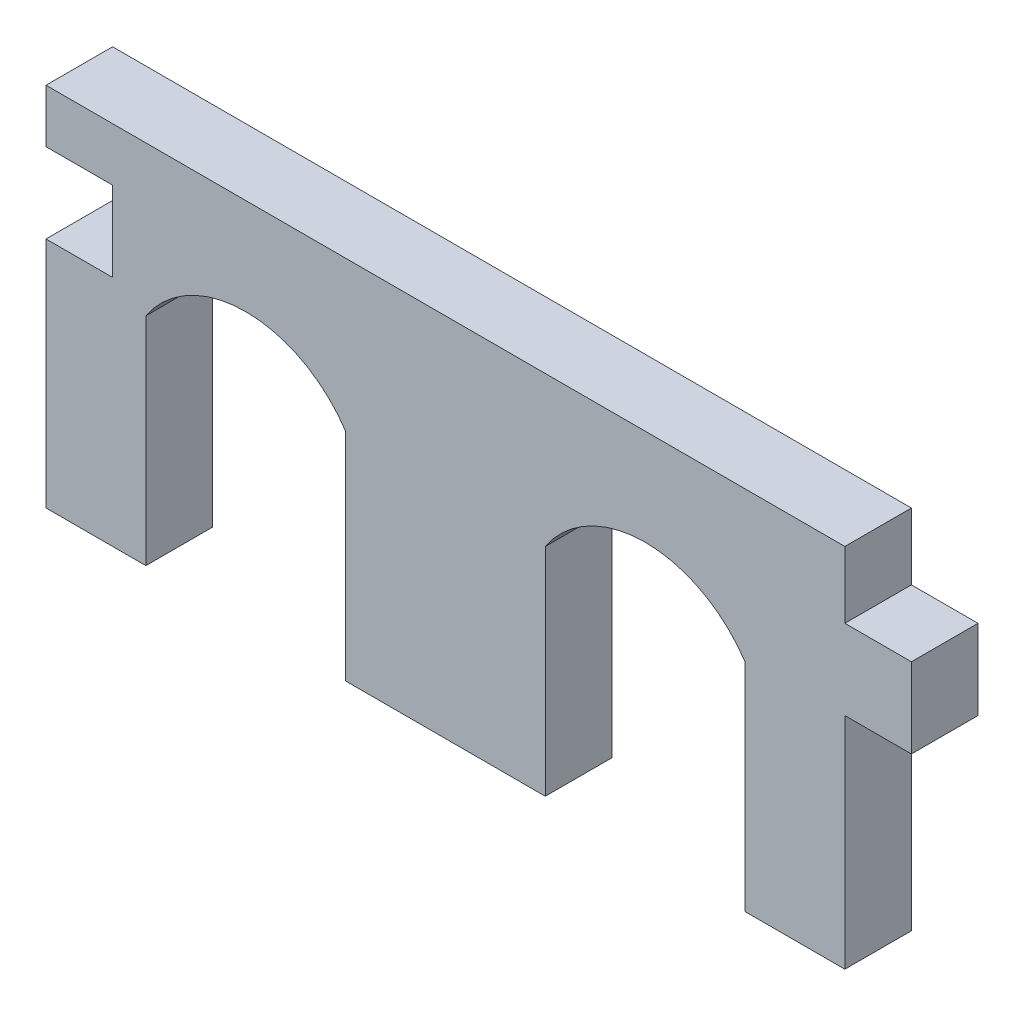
ISO-10303-21;
HEADER;
FILE_DESCRIPTION(('STEP AP214'),'2;1');
FILE_NAME('part.step','',(''),(''),'','','');
FILE_SCHEMA(('AUTOMOTIVE_DESIGN { 1 0 10303 214 1 1 1 1 }'));
ENDSEC;
DATA;
#1=APPLICATION_CONTEXT('core data for automotive mechanical design processes');
#2=APPLICATION_PROTOCOL_DEFINITION('international standard','automotive_design',2000,#1);
#3=PRODUCT_CONTEXT('',#1,'mechanical');
#4=PRODUCT('Part','Part','',(#3));
#5=PRODUCT_RELATED_PRODUCT_CATEGORY('part','',(#4));
#6=PRODUCT_DEFINITION_FORMATION('','',#4);
#7=PRODUCT_DEFINITION_CONTEXT('part definition',#1,'design');
#8=PRODUCT_DEFINITION('design','',#6,#7);
#9=PRODUCT_DEFINITION_SHAPE('','',#8);
#10=(LENGTH_UNIT() NAMED_UNIT(*) SI_UNIT(.MILLI.,.METRE.));
#11=(NAMED_UNIT(*) PLANE_ANGLE_UNIT() SI_UNIT($,.RADIAN.));
#12=(NAMED_UNIT(*) SI_UNIT($,.STERADIAN.) SOLID_ANGLE_UNIT());
#13=UNCERTAINTY_MEASURE_WITH_UNIT(LENGTH_MEASURE(1.E-05),#10,'distance_accuracy_value','');
#14=(GEOMETRIC_REPRESENTATION_CONTEXT(3) GLOBAL_UNCERTAINTY_ASSIGNED_CONTEXT((#13)) GLOBAL_UNIT_ASSIGNED_CONTEXT((#10,
#11,#12)) REPRESENTATION_CONTEXT('',''));
#15=CARTESIAN_POINT('',(0.,0.,0.));
#16=DIRECTION('',(0.,0.,1.));
#17=DIRECTION('',(1.,0.,0.));
#18=AXIS2_PLACEMENT_3D('',#15,#16,#17);
#19=CARTESIAN_POINT('',(0.,-6.35,6.35));
#20=DIRECTION('',(0.,1.,0.));
#21=DIRECTION('',(0.,0.,1.));
#22=AXIS2_PLACEMENT_3D('',#19,#20,#21);
#23=PLANE('',#22);
#24=DIRECTION('',(1.,0.,0.));
#25=VECTOR('',#24,1.);
#26=CARTESIAN_POINT('',(0.,-6.35,0.));
#27=LINE('',#26,#25);
#28=CARTESIAN_POINT('',(-47.625,-6.35,0.));
#29=VERTEX_POINT('',#28);
#30=CARTESIAN_POINT('',(-28.575,-6.35,0.));
#31=VERTEX_POINT('',#30);
#32=EDGE_CURVE('E221',#29,#31,#27,.T.);
#33=ORIENTED_EDGE('',*,*,#32,.T.);
#34=DIRECTION('',(0.,0.,-1.));
#35=VECTOR('',#34,1.);
#36=CARTESIAN_POINT('',(-28.575,-6.35,6.35));
#37=LINE('',#36,#35);
#38=CARTESIAN_POINT('',(-28.575,-6.35,6.35));
#39=VERTEX_POINT('',#38);
#40=EDGE_CURVE('E11',#39,#31,#37,.T.);
#41=ORIENTED_EDGE('',*,*,#40,.F.);
#42=DIRECTION('',(1.,0.,0.));
#43=VECTOR('',#42,1.);
#44=CARTESIAN_POINT('',(0.,-6.35,6.35));
#45=LINE('',#44,#43);
#46=CARTESIAN_POINT('',(-47.625,-6.35,6.35));
#47=VERTEX_POINT('',#46);
#48=EDGE_CURVE('E287',#47,#39,#45,.T.);
#49=ORIENTED_EDGE('',*,*,#48,.F.);
#50=DIRECTION('',(0.,0.,-1.));
#51=VECTOR('',#50,1.);
#52=CARTESIAN_POINT('',(-47.625,-6.35,6.35));
#53=LINE('',#52,#51);
#54=EDGE_CURVE('E64',#47,#29,#53,.T.);
#55=ORIENTED_EDGE('',*,*,#54,.T.);
#56=EDGE_LOOP('',(#33,#41,#49,#55));
#57=FACE_BOUND('',#56,.T.);
#58=ADVANCED_FACE('F47',(#57),#23,.F.);
#59=CARTESIAN_POINT('',(-28.575,0.,6.35));
#60=DIRECTION('',(-1.,0.,0.));
#61=DIRECTION('',(0.,-1.,0.));
#62=AXIS2_PLACEMENT_3D('',#59,#60,#61);
#63=PLANE('',#62);
#64=DIRECTION('',(0.,1.,0.));
#65=VECTOR('',#64,1.);
#66=CARTESIAN_POINT('',(-28.575,0.,0.));
#67=LINE('',#66,#65);
#68=CARTESIAN_POINT('',(-28.575,14.2875,0.));
#69=VERTEX_POINT('',#68);
#70=EDGE_CURVE('E224',#31,#69,#67,.T.);
#71=ORIENTED_EDGE('',*,*,#70,.T.);
#72=DIRECTION('',(0.,0.,-1.));
#73=VECTOR('',#72,1.);
#74=CARTESIAN_POINT('',(-28.575,14.2875,6.35));
#75=LINE('',#74,#73);
#76=CARTESIAN_POINT('',(-28.575,14.2875,6.35));
#77=VERTEX_POINT('',#76);
#78=EDGE_CURVE('E56',#77,#69,#75,.T.);
#79=ORIENTED_EDGE('',*,*,#78,.F.);
#80=DIRECTION('',(0.,1.,0.));
#81=VECTOR('',#80,1.);
#82=CARTESIAN_POINT('',(-28.575,0.,6.35));
#83=LINE('',#82,#81);
#84=EDGE_CURVE('E139',#39,#77,#83,.T.);
#85=ORIENTED_EDGE('',*,*,#84,.F.);
#86=ORIENTED_EDGE('',*,*,#40,.T.);
#87=EDGE_LOOP('',(#71,#79,#85,#86));
#88=FACE_BOUND('',#87,.T.);
#89=ADVANCED_FACE('F420',(#88),#63,.F.);
#90=CARTESIAN_POINT('',(-19.05,7.96932977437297,6.35));
#91=DIRECTION('',(0.,0.,-1.));
#92=DIRECTION('',(-1.,0.,0.));
#93=AXIS2_PLACEMENT_3D('',#90,#91,#92);
#94=CYLINDRICAL_SURFACE('',#93,11.43);
#95=CARTESIAN_POINT('',(-19.05,7.96932977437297,0.));
#96=DIRECTION('',(0.,0.,1.));
#97=DIRECTION('',(1.,0.,0.));
#98=AXIS2_PLACEMENT_3D('',#95,#96,#97);
#99=CIRCLE('',#98,11.43);
#100=CARTESIAN_POINT('',(-9.52500000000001,14.2875,0.));
#101=VERTEX_POINT('',#100);
#102=EDGE_CURVE('E227',#69,#101,#99,.F.);
#103=ORIENTED_EDGE('',*,*,#102,.T.);
#104=DIRECTION('',(0.,0.,-1.));
#105=VECTOR('',#104,1.);
#106=CARTESIAN_POINT('',(-9.52500000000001,14.2875,6.35));
#107=LINE('',#106,#105);
#108=CARTESIAN_POINT('',(-9.52500000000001,14.2875,6.35));
#109=VERTEX_POINT('',#108);
#110=EDGE_CURVE('E336',#109,#101,#107,.T.);
#111=ORIENTED_EDGE('',*,*,#110,.F.);
#112=CARTESIAN_POINT('',(-19.05,7.96932977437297,6.35));
#113=DIRECTION('',(0.,0.,1.));
#114=DIRECTION('',(1.,0.,0.));
#115=AXIS2_PLACEMENT_3D('',#112,#113,#114);
#116=CIRCLE('',#115,11.43);
#117=EDGE_CURVE('E345',#77,#109,#116,.F.);
#118=ORIENTED_EDGE('',*,*,#117,.F.);
#119=ORIENTED_EDGE('',*,*,#78,.T.);
#120=EDGE_LOOP('',(#103,#111,#118,#119));
#121=FACE_BOUND('',#120,.T.);
#122=ADVANCED_FACE('F343',(#121),#94,.F.);
#123=CARTESIAN_POINT('',(-9.52500000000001,0.,6.35));
#124=DIRECTION('',(-1.,0.,0.));
#125=DIRECTION('',(0.,0.,1.));
#126=AXIS2_PLACEMENT_3D('',#123,#124,#125);
#127=PLANE('',#126);
#128=DIRECTION('',(0.,1.,0.));
#129=VECTOR('',#128,1.);
#130=CARTESIAN_POINT('',(-9.52500000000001,0.,0.));
#131=LINE('',#130,#129);
#132=CARTESIAN_POINT('',(-9.52500000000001,-6.35,0.));
#133=VERTEX_POINT('',#132);
#134=EDGE_CURVE('E231',#133,#101,#131,.T.);
#135=ORIENTED_EDGE('',*,*,#134,.F.);
#136=DIRECTION('',(0.,0.,-1.));
#137=VECTOR('',#136,1.);
#138=CARTESIAN_POINT('',(-9.52500000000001,-6.35,6.35));
#139=LINE('',#138,#137);
#140=CARTESIAN_POINT('',(-9.52500000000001,-6.35,6.35));
#141=VERTEX_POINT('',#140);
#142=EDGE_CURVE('E333',#141,#133,#139,.T.);
#143=ORIENTED_EDGE('',*,*,#142,.F.);
#144=DIRECTION('',(0.,1.,0.));
#145=VECTOR('',#144,1.);
#146=CARTESIAN_POINT('',(-9.52500000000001,0.,6.35));
#147=LINE('',#146,#145);
#148=EDGE_CURVE('E355',#141,#109,#147,.T.);
#149=ORIENTED_EDGE('',*,*,#148,.T.);
#150=ORIENTED_EDGE('',*,*,#110,.T.);
#151=EDGE_LOOP('',(#135,#143,#149,#150));
#152=FACE_BOUND('',#151,.T.);
#153=ADVANCED_FACE('F351',(#152),#127,.T.);
#154=CARTESIAN_POINT('',(0.,-6.35,6.35));
#155=DIRECTION('',(0.,1.,0.));
#156=DIRECTION('',(0.,0.,1.));
#157=AXIS2_PLACEMENT_3D('',#154,#155,#156);
#158=PLANE('',#157);
#159=DIRECTION('',(1.,0.,0.));
#160=VECTOR('',#159,1.);
#161=CARTESIAN_POINT('',(0.,-6.35,0.));
#162=LINE('',#161,#160);
#163=CARTESIAN_POINT('',(0.,-6.35,0.));
#164=VERTEX_POINT('',#163);
#165=EDGE_CURVE('E235',#133,#164,#162,.T.);
#166=ORIENTED_EDGE('',*,*,#165,.T.);
#167=DIRECTION('',(0.,0.,-1.));
#168=VECTOR('',#167,1.);
#169=CARTESIAN_POINT('',(0.,-6.35,6.35));
#170=LINE('',#169,#168);
#171=CARTESIAN_POINT('',(0.,-6.35,6.35));
#172=VERTEX_POINT('',#171);
#173=EDGE_CURVE('E330',#172,#164,#170,.T.);
#174=ORIENTED_EDGE('',*,*,#173,.F.);
#175=DIRECTION('',(1.,0.,0.));
#176=VECTOR('',#175,1.);
#177=CARTESIAN_POINT('',(0.,-6.35,6.35));
#178=LINE('',#177,#176);
#179=EDGE_CURVE('E357',#141,#172,#178,.T.);
#180=ORIENTED_EDGE('',*,*,#179,.F.);
#181=ORIENTED_EDGE('',*,*,#142,.T.);
#182=EDGE_LOOP('',(#166,#174,#180,#181));
#183=FACE_BOUND('',#182,.T.);
#184=ADVANCED_FACE('F456',(#183),#158,.F.);
#185=CARTESIAN_POINT('',(0.,0.,6.35));
#186=DIRECTION('',(1.,0.,0.));
#187=DIRECTION('',(0.,1.,0.));
#188=AXIS2_PLACEMENT_3D('',#185,#186,#187);
#189=PLANE('',#188);
#190=DIRECTION('',(0.,-1.,0.));
#191=VECTOR('',#190,1.);
#192=CARTESIAN_POINT('',(0.,0.,0.));
#193=LINE('',#192,#191);
#194=CARTESIAN_POINT('',(0.,14.605,0.));
#195=VERTEX_POINT('',#194);
#196=EDGE_CURVE('E239',#195,#164,#193,.T.);
#197=ORIENTED_EDGE('',*,*,#196,.F.);
#198=DIRECTION('',(0.,0.,-1.));
#199=VECTOR('',#198,1.);
#200=CARTESIAN_POINT('',(0.,14.605,6.35));
#201=LINE('',#200,#199);
#202=CARTESIAN_POINT('',(0.,14.605,6.35));
#203=VERTEX_POINT('',#202);
#204=EDGE_CURVE('E327',#203,#195,#201,.T.);
#205=ORIENTED_EDGE('',*,*,#204,.F.);
#206=DIRECTION('',(0.,-1.,0.));
#207=VECTOR('',#206,1.);
#208=CARTESIAN_POINT('',(0.,0.,6.35));
#209=LINE('',#208,#207);
#210=EDGE_CURVE('E361',#203,#172,#209,.T.);
#211=ORIENTED_EDGE('',*,*,#210,.T.);
#212=ORIENTED_EDGE('',*,*,#173,.T.);
#213=EDGE_LOOP('',(#197,#205,#211,#212));
#214=FACE_BOUND('',#213,.T.);
#215=ADVANCED_FACE('F451',(#214),#189,.T.);
#216=CARTESIAN_POINT('',(0.,14.605,6.35));
#217=DIRECTION('',(0.,1.,0.));
#218=DIRECTION('',(0.,0.,1.));
#219=AXIS2_PLACEMENT_3D('',#216,#217,#218);
#220=PLANE('',#219);
#221=DIRECTION('',(1.,0.,0.));
#222=VECTOR('',#221,1.);
#223=CARTESIAN_POINT('',(0.,14.605,0.));
#224=LINE('',#223,#222);
#225=CARTESIAN_POINT('',(6.35,14.605,0.));
#226=VERTEX_POINT('',#225);
#227=EDGE_CURVE('E243',#195,#226,#224,.T.);
#228=ORIENTED_EDGE('',*,*,#227,.T.);
#229=DIRECTION('',(0.,0.,-1.));
#230=VECTOR('',#229,1.);
#231=CARTESIAN_POINT('',(6.35,14.605,6.35));
#232=LINE('',#231,#230);
#233=CARTESIAN_POINT('',(6.35,14.605,6.35));
#234=VERTEX_POINT('',#233);
#235=EDGE_CURVE('E324',#234,#226,#232,.T.);
#236=ORIENTED_EDGE('',*,*,#235,.F.);
#237=DIRECTION('',(1.,0.,0.));
#238=VECTOR('',#237,1.);
#239=CARTESIAN_POINT('',(0.,14.605,6.35));
#240=LINE('',#239,#238);
#241=EDGE_CURVE('E369',#203,#234,#240,.T.);
#242=ORIENTED_EDGE('',*,*,#241,.F.);
#243=ORIENTED_EDGE('',*,*,#204,.T.);
#244=EDGE_LOOP('',(#228,#236,#242,#243));
#245=FACE_BOUND('',#244,.T.);
#246=ADVANCED_FACE('F457',(#245),#220,.F.);
#247=CARTESIAN_POINT('',(6.35000000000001,0.,6.35));
#248=DIRECTION('',(1.,0.,0.));
#249=DIRECTION('',(0.,1.,0.));
#250=AXIS2_PLACEMENT_3D('',#247,#248,#249);
#251=PLANE('',#250);
#252=DIRECTION('',(0.,-1.,0.));
#253=VECTOR('',#252,1.);
#254=CARTESIAN_POINT('',(6.35000000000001,0.,0.));
#255=LINE('',#254,#253);
#256=CARTESIAN_POINT('',(6.35,22.225,0.));
#257=VERTEX_POINT('',#256);
#258=EDGE_CURVE('E248',#257,#226,#255,.T.);
#259=ORIENTED_EDGE('',*,*,#258,.F.);
#260=DIRECTION('',(0.,0.,-1.));
#261=VECTOR('',#260,1.);
#262=CARTESIAN_POINT('',(6.35,22.225,6.35));
#263=LINE('',#262,#261);
#264=CARTESIAN_POINT('',(6.35,22.225,6.35));
#265=VERTEX_POINT('',#264);
#266=EDGE_CURVE('E321',#265,#257,#263,.T.);
#267=ORIENTED_EDGE('',*,*,#266,.F.);
#268=DIRECTION('',(0.,-1.,0.));
#269=VECTOR('',#268,1.);
#270=CARTESIAN_POINT('',(6.35000000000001,0.,6.35));
#271=LINE('',#270,#269);
#272=EDGE_CURVE('E373',#265,#234,#271,.T.);
#273=ORIENTED_EDGE('',*,*,#272,.T.);
#274=ORIENTED_EDGE('',*,*,#235,.T.);
#275=EDGE_LOOP('',(#259,#267,#273,#274));
#276=FACE_BOUND('',#275,.T.);
#277=ADVANCED_FACE('F445',(#276),#251,.T.);
#278=CARTESIAN_POINT('',(0.,22.225,6.35));
#279=DIRECTION('',(0.,1.,0.));
#280=DIRECTION('',(0.,0.,1.));
#281=AXIS2_PLACEMENT_3D('',#278,#279,#280);
#282=PLANE('',#281);
#283=DIRECTION('',(1.,0.,0.));
#284=VECTOR('',#283,1.);
#285=CARTESIAN_POINT('',(0.,22.225,0.));
#286=LINE('',#285,#284);
#287=CARTESIAN_POINT('',(0.,22.225,0.));
#288=VERTEX_POINT('',#287);
#289=EDGE_CURVE('E252',#288,#257,#286,.T.);
#290=ORIENTED_EDGE('',*,*,#289,.F.);
#291=DIRECTION('',(0.,0.,-1.));
#292=VECTOR('',#291,1.);
#293=CARTESIAN_POINT('',(0.,22.225,6.35));
#294=LINE('',#293,#292);
#295=CARTESIAN_POINT('',(0.,22.225,6.35));
#296=VERTEX_POINT('',#295);
#297=EDGE_CURVE('E318',#296,#288,#294,.T.);
#298=ORIENTED_EDGE('',*,*,#297,.F.);
#299=DIRECTION('',(1.,0.,0.));
#300=VECTOR('',#299,1.);
#301=CARTESIAN_POINT('',(0.,22.225,6.35));
#302=LINE('',#301,#300);
#303=EDGE_CURVE('E377',#296,#265,#302,.T.);
#304=ORIENTED_EDGE('',*,*,#303,.T.);
#305=ORIENTED_EDGE('',*,*,#266,.T.);
#306=EDGE_LOOP('',(#290,#298,#304,#305));
#307=FACE_BOUND('',#306,.T.);
#308=ADVANCED_FACE('F441',(#307),#282,.T.);
#309=CARTESIAN_POINT('',(0.,28.575,0.));
#310=VERTEX_POINT('',#309);
#311=EDGE_CURVE('E244',#310,#288,#193,.T.);
#312=ORIENTED_EDGE('',*,*,#311,.F.);
#313=DIRECTION('',(0.,0.,-1.));
#314=VECTOR('',#313,1.);
#315=CARTESIAN_POINT('',(0.,28.575,6.35));
#316=LINE('',#315,#314);
#317=CARTESIAN_POINT('',(0.,28.575,6.35));
#318=VERTEX_POINT('',#317);
#319=EDGE_CURVE('E315',#318,#310,#316,.T.);
#320=ORIENTED_EDGE('',*,*,#319,.F.);
#321=EDGE_CURVE('E370',#318,#296,#209,.T.);
#322=ORIENTED_EDGE('',*,*,#321,.T.);
#323=ORIENTED_EDGE('',*,*,#297,.T.);
#324=EDGE_LOOP('',(#312,#320,#322,#323));
#325=FACE_BOUND('',#324,.T.);
#326=ADVANCED_FACE('F436',(#325),#189,.T.);
#327=CARTESIAN_POINT('',(0.,28.575,6.35));
#328=DIRECTION('',(0.,1.,0.));
#329=DIRECTION('',(0.,0.,1.));
#330=AXIS2_PLACEMENT_3D('',#327,#328,#329);
#331=PLANE('',#330);
#332=DIRECTION('',(1.,0.,0.));
#333=VECTOR('',#332,1.);
#334=CARTESIAN_POINT('',(0.,28.575,0.));
#335=LINE('',#334,#333);
#336=CARTESIAN_POINT('',(-76.2,28.575,0.));
#337=VERTEX_POINT('',#336);
#338=EDGE_CURVE('E256',#337,#310,#335,.T.);
#339=ORIENTED_EDGE('',*,*,#338,.F.);
#340=DIRECTION('',(0.,0.,-1.));
#341=VECTOR('',#340,1.);
#342=CARTESIAN_POINT('',(-76.2,28.575,6.35));
#343=LINE('',#342,#341);
#344=CARTESIAN_POINT('',(-76.2,28.575,6.35));
#345=VERTEX_POINT('',#344);
#346=EDGE_CURVE('E312',#345,#337,#343,.T.);
#347=ORIENTED_EDGE('',*,*,#346,.F.);
#348=DIRECTION('',(1.,0.,0.));
#349=VECTOR('',#348,1.);
#350=CARTESIAN_POINT('',(0.,28.575,6.35));
#351=LINE('',#350,#349);
#352=EDGE_CURVE('E381',#345,#318,#351,.T.);
#353=ORIENTED_EDGE('',*,*,#352,.T.);
#354=ORIENTED_EDGE('',*,*,#319,.T.);
#355=EDGE_LOOP('',(#339,#347,#353,#354));
#356=FACE_BOUND('',#355,.T.);
#357=ADVANCED_FACE('F522',(#356),#331,.T.);
#358=CARTESIAN_POINT('',(-76.2,0.,6.35));
#359=DIRECTION('',(1.,0.,0.));
#360=DIRECTION('',(0.,1.,0.));
#361=AXIS2_PLACEMENT_3D('',#358,#359,#360);
#362=PLANE('',#361);
#363=DIRECTION('',(0.,-1.,0.));
#364=VECTOR('',#363,1.);
#365=CARTESIAN_POINT('',(-76.2,0.,0.));
#366=LINE('',#365,#364);
#367=CARTESIAN_POINT('',(-76.2,23.495,0.));
#368=VERTEX_POINT('',#367);
#369=EDGE_CURVE('E260',#337,#368,#366,.T.);
#370=ORIENTED_EDGE('',*,*,#369,.T.);
#371=DIRECTION('',(0.,0.,-1.));
#372=VECTOR('',#371,1.);
#373=CARTESIAN_POINT('',(-76.2,23.495,6.35));
#374=LINE('',#373,#372);
#375=CARTESIAN_POINT('',(-76.2,23.495,6.35));
#376=VERTEX_POINT('',#375);
#377=EDGE_CURVE('E308',#376,#368,#374,.T.);
#378=ORIENTED_EDGE('',*,*,#377,.F.);
#379=DIRECTION('',(0.,-1.,0.));
#380=VECTOR('',#379,1.);
#381=CARTESIAN_POINT('',(-76.2,0.,6.35));
#382=LINE('',#381,#380);
#383=EDGE_CURVE('E385',#345,#376,#382,.T.);
#384=ORIENTED_EDGE('',*,*,#383,.F.);
#385=ORIENTED_EDGE('',*,*,#346,.T.);
#386=EDGE_LOOP('',(#370,#378,#384,#385));
#387=FACE_BOUND('',#386,.T.);
#388=ADVANCED_FACE('F533',(#387),#362,.F.);
#389=CARTESIAN_POINT('',(0.,23.4950000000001,6.35));
#390=DIRECTION('',(0.,1.,0.));
#391=DIRECTION('',(-1.,0.,0.));
#392=AXIS2_PLACEMENT_3D('',#389,#390,#391);
#393=PLANE('',#392);
#394=DIRECTION('',(1.,0.,0.));
#395=VECTOR('',#394,1.);
#396=CARTESIAN_POINT('',(0.,23.4950000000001,0.));
#397=LINE('',#396,#395);
#398=CARTESIAN_POINT('',(-69.85,23.495,0.));
#399=VERTEX_POINT('',#398);
#400=EDGE_CURVE('E263',#368,#399,#397,.T.);
#401=ORIENTED_EDGE('',*,*,#400,.T.);
#402=DIRECTION('',(0.,0.,-1.));
#403=VECTOR('',#402,1.);
#404=CARTESIAN_POINT('',(-69.85,23.495,6.35));
#405=LINE('',#404,#403);
#406=CARTESIAN_POINT('',(-69.85,23.495,6.35));
#407=VERTEX_POINT('',#406);
#408=EDGE_CURVE('E304',#407,#399,#405,.T.);
#409=ORIENTED_EDGE('',*,*,#408,.F.);
#410=DIRECTION('',(1.,0.,0.));
#411=VECTOR('',#410,1.);
#412=CARTESIAN_POINT('',(0.,23.4950000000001,6.35));
#413=LINE('',#412,#411);
#414=EDGE_CURVE('E388',#376,#407,#413,.T.);
#415=ORIENTED_EDGE('',*,*,#414,.F.);
#416=ORIENTED_EDGE('',*,*,#377,.T.);
#417=EDGE_LOOP('',(#401,#409,#415,#416));
#418=FACE_BOUND('',#417,.T.);
#419=ADVANCED_FACE('F543',(#418),#393,.F.);
#420=CARTESIAN_POINT('',(-69.85,0.,6.35));
#421=DIRECTION('',(1.,0.,0.));
#422=DIRECTION('',(0.,0.,-1.));
#423=AXIS2_PLACEMENT_3D('',#420,#421,#422);
#424=PLANE('',#423);
#425=DIRECTION('',(0.,-1.,0.));
#426=VECTOR('',#425,1.);
#427=CARTESIAN_POINT('',(-69.85,0.,0.));
#428=LINE('',#427,#426);
#429=CARTESIAN_POINT('',(-69.85,15.875,0.));
#430=VERTEX_POINT('',#429);
#431=EDGE_CURVE('E267',#399,#430,#428,.T.);
#432=ORIENTED_EDGE('',*,*,#431,.T.);
#433=DIRECTION('',(0.,0.,-1.));
#434=VECTOR('',#433,1.);
#435=CARTESIAN_POINT('',(-69.85,15.875,6.35));
#436=LINE('',#435,#434);
#437=CARTESIAN_POINT('',(-69.85,15.875,6.35));
#438=VERTEX_POINT('',#437);
#439=EDGE_CURVE('E301',#438,#430,#436,.T.);
#440=ORIENTED_EDGE('',*,*,#439,.F.);
#441=DIRECTION('',(0.,-1.,0.));
#442=VECTOR('',#441,1.);
#443=CARTESIAN_POINT('',(-69.85,0.,6.35));
#444=LINE('',#443,#442);
#445=EDGE_CURVE('E392',#407,#438,#444,.T.);
#446=ORIENTED_EDGE('',*,*,#445,.F.);
#447=ORIENTED_EDGE('',*,*,#408,.T.);
#448=EDGE_LOOP('',(#432,#440,#446,#447));
#449=FACE_BOUND('',#448,.T.);
#450=ADVANCED_FACE('F553',(#449),#424,.F.);
#451=CARTESIAN_POINT('',(0.,15.875,6.35));
#452=DIRECTION('',(0.,1.,0.));
#453=DIRECTION('',(0.,0.,1.));
#454=AXIS2_PLACEMENT_3D('',#451,#452,#453);
#455=PLANE('',#454);
#456=DIRECTION('',(1.,0.,0.));
#457=VECTOR('',#456,1.);
#458=CARTESIAN_POINT('',(0.,15.875,0.));
#459=LINE('',#458,#457);
#460=CARTESIAN_POINT('',(-76.2,15.875,0.));
#461=VERTEX_POINT('',#460);
#462=EDGE_CURVE('E271',#461,#430,#459,.T.);
#463=ORIENTED_EDGE('',*,*,#462,.F.);
#464=DIRECTION('',(0.,0.,-1.));
#465=VECTOR('',#464,1.);
#466=CARTESIAN_POINT('',(-76.2,15.875,6.35));
#467=LINE('',#466,#465);
#468=CARTESIAN_POINT('',(-76.2,15.875,6.35));
#469=VERTEX_POINT('',#468);
#470=EDGE_CURVE('E298',#469,#461,#467,.T.);
#471=ORIENTED_EDGE('',*,*,#470,.F.);
#472=DIRECTION('',(1.,0.,0.));
#473=VECTOR('',#472,1.);
#474=CARTESIAN_POINT('',(0.,15.875,6.35));
#475=LINE('',#474,#473);
#476=EDGE_CURVE('E395',#469,#438,#475,.T.);
#477=ORIENTED_EDGE('',*,*,#476,.T.);
#478=ORIENTED_EDGE('',*,*,#439,.T.);
#479=EDGE_LOOP('',(#463,#471,#477,#478));
#480=FACE_BOUND('',#479,.T.);
#481=ADVANCED_FACE('F563',(#480),#455,.T.);
#482=CARTESIAN_POINT('',(-76.2,-6.35,0.));
#483=VERTEX_POINT('',#482);
#484=EDGE_CURVE('E264',#461,#483,#366,.T.);
#485=ORIENTED_EDGE('',*,*,#484,.T.);
#486=DIRECTION('',(0.,0.,-1.));
#487=VECTOR('',#486,1.);
#488=CARTESIAN_POINT('',(-76.2,-6.35,6.35));
#489=LINE('',#488,#487);
#490=CARTESIAN_POINT('',(-76.2,-6.35,6.35));
#491=VERTEX_POINT('',#490);
#492=EDGE_CURVE('E294',#491,#483,#489,.T.);
#493=ORIENTED_EDGE('',*,*,#492,.F.);
#494=EDGE_CURVE('E389',#469,#491,#382,.T.);
#495=ORIENTED_EDGE('',*,*,#494,.F.);
#496=ORIENTED_EDGE('',*,*,#470,.T.);
#497=EDGE_LOOP('',(#485,#493,#495,#496));
#498=FACE_BOUND('',#497,.T.);
#499=ADVANCED_FACE('F404',(#498),#362,.F.);
#500=CARTESIAN_POINT('',(0.,-6.35,6.35));
#501=DIRECTION('',(0.,1.,0.));
#502=DIRECTION('',(0.,0.,1.));
#503=AXIS2_PLACEMENT_3D('',#500,#501,#502);
#504=PLANE('',#503);
#505=DIRECTION('',(1.,0.,0.));
#506=VECTOR('',#505,1.);
#507=CARTESIAN_POINT('',(0.,-6.35,0.));
#508=LINE('',#507,#506);
#509=CARTESIAN_POINT('',(-66.675,-6.35,0.));
#510=VERTEX_POINT('',#509);
#511=EDGE_CURVE('E275',#483,#510,#508,.T.);
#512=ORIENTED_EDGE('',*,*,#511,.T.);
#513=DIRECTION('',(0.,0.,-1.));
#514=VECTOR('',#513,1.);
#515=CARTESIAN_POINT('',(-66.675,-6.35,6.35));
#516=LINE('',#515,#514);
#517=CARTESIAN_POINT('',(-66.675,-6.35,6.35));
#518=VERTEX_POINT('',#517);
#519=EDGE_CURVE('E211',#518,#510,#516,.T.);
#520=ORIENTED_EDGE('',*,*,#519,.F.);
#521=DIRECTION('',(1.,0.,0.));
#522=VECTOR('',#521,1.);
#523=CARTESIAN_POINT('',(0.,-6.35,6.35));
#524=LINE('',#523,#522);
#525=EDGE_CURVE('E197',#491,#518,#524,.T.);
#526=ORIENTED_EDGE('',*,*,#525,.F.);
#527=ORIENTED_EDGE('',*,*,#492,.T.);
#528=EDGE_LOOP('',(#512,#520,#526,#527));
#529=FACE_BOUND('',#528,.T.);
#530=ADVANCED_FACE('F408',(#529),#504,.F.);
#531=CARTESIAN_POINT('',(-66.675,0.,6.35));
#532=DIRECTION('',(-1.,0.,0.));
#533=DIRECTION('',(0.,0.,1.));
#534=AXIS2_PLACEMENT_3D('',#531,#532,#533);
#535=PLANE('',#534);
#536=DIRECTION('',(0.,1.,0.));
#537=VECTOR('',#536,1.);
#538=CARTESIAN_POINT('',(-66.675,0.,0.));
#539=LINE('',#538,#537);
#540=CARTESIAN_POINT('',(-66.675,14.2875,0.));
#541=VERTEX_POINT('',#540);
#542=EDGE_CURVE('E207',#510,#541,#539,.T.);
#543=ORIENTED_EDGE('',*,*,#542,.T.);
#544=DIRECTION('',(0.,0.,-1.));
#545=VECTOR('',#544,1.);
#546=CARTESIAN_POINT('',(-66.675,14.2875,6.35));
#547=LINE('',#546,#545);
#548=CARTESIAN_POINT('',(-66.675,14.2875,6.35));
#549=VERTEX_POINT('',#548);
#550=EDGE_CURVE('E204',#549,#541,#547,.T.);
#551=ORIENTED_EDGE('',*,*,#550,.F.);
#552=DIRECTION('',(0.,1.,0.));
#553=VECTOR('',#552,1.);
#554=CARTESIAN_POINT('',(-66.675,0.,6.35));
#555=LINE('',#554,#553);
#556=EDGE_CURVE('E190',#518,#549,#555,.T.);
#557=ORIENTED_EDGE('',*,*,#556,.F.);
#558=ORIENTED_EDGE('',*,*,#519,.T.);
#559=EDGE_LOOP('',(#543,#551,#557,#558));
#560=FACE_BOUND('',#559,.T.);
#561=ADVANCED_FACE('F205',(#560),#535,.F.);
#562=CARTESIAN_POINT('',(-57.15,7.96932977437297,6.35));
#563=DIRECTION('',(0.,0.,-1.));
#564=DIRECTION('',(-1.,0.,0.));
#565=AXIS2_PLACEMENT_3D('',#562,#563,#564);
#566=CYLINDRICAL_SURFACE('',#565,11.43);
#567=CARTESIAN_POINT('',(-57.15,7.96932977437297,0.));
#568=DIRECTION('',(0.,0.,1.));
#569=DIRECTION('',(1.,0.,0.));
#570=AXIS2_PLACEMENT_3D('',#567,#568,#569);
#571=CIRCLE('',#570,11.43);
#572=CARTESIAN_POINT('',(-47.625,14.2875,0.));
#573=VERTEX_POINT('',#572);
#574=EDGE_CURVE('E280',#541,#573,#571,.F.);
#575=ORIENTED_EDGE('',*,*,#574,.T.);
#576=DIRECTION('',(0.,0.,-1.));
#577=VECTOR('',#576,1.);
#578=CARTESIAN_POINT('',(-47.625,14.2875,6.35));
#579=LINE('',#578,#577);
#580=CARTESIAN_POINT('',(-47.625,14.2875,6.35));
#581=VERTEX_POINT('',#580);
#582=EDGE_CURVE('E127',#581,#573,#579,.T.);
#583=ORIENTED_EDGE('',*,*,#582,.F.);
#584=CARTESIAN_POINT('',(-57.15,7.96932977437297,6.35));
#585=DIRECTION('',(0.,0.,1.));
#586=DIRECTION('',(1.,0.,0.));
#587=AXIS2_PLACEMENT_3D('',#584,#585,#586);
#588=CIRCLE('',#587,11.43);
#589=EDGE_CURVE('E195',#549,#581,#588,.F.);
#590=ORIENTED_EDGE('',*,*,#589,.F.);
#591=ORIENTED_EDGE('',*,*,#550,.T.);
#592=EDGE_LOOP('',(#575,#583,#590,#591));
#593=FACE_BOUND('',#592,.T.);
#594=ADVANCED_FACE('F213',(#593),#566,.F.);
#595=CARTESIAN_POINT('',(-47.625,0.,6.35));
#596=DIRECTION('',(-1.,0.,0.));
#597=DIRECTION('',(0.,0.,1.));
#598=AXIS2_PLACEMENT_3D('',#595,#596,#597);
#599=PLANE('',#598);
#600=DIRECTION('',(0.,1.,0.));
#601=VECTOR('',#600,1.);
#602=CARTESIAN_POINT('',(-47.625,0.,0.));
#603=LINE('',#602,#601);
#604=EDGE_CURVE('E283',#29,#573,#603,.T.);
#605=ORIENTED_EDGE('',*,*,#604,.F.);
#606=ORIENTED_EDGE('',*,*,#54,.F.);
#607=DIRECTION('',(0.,1.,0.));
#608=VECTOR('',#607,1.);
#609=CARTESIAN_POINT('',(-47.625,0.,6.35));
#610=LINE('',#609,#608);
#611=EDGE_CURVE('E215',#47,#581,#610,.T.);
#612=ORIENTED_EDGE('',*,*,#611,.T.);
#613=ORIENTED_EDGE('',*,*,#582,.T.);
#614=EDGE_LOOP('',(#605,#606,#612,#613));
#615=FACE_BOUND('',#614,.T.);
#616=ADVANCED_FACE('F409',(#615),#599,.T.);
#617=CARTESIAN_POINT('',(0.,0.,6.35));
#618=DIRECTION('',(0.,0.,1.));
#619=DIRECTION('',(1.,0.,0.));
#620=AXIS2_PLACEMENT_3D('',#617,#618,#619);
#621=PLANE('',#620);
#622=ORIENTED_EDGE('',*,*,#48,.T.);
#623=ORIENTED_EDGE('',*,*,#84,.T.);
#624=ORIENTED_EDGE('',*,*,#117,.T.);
#625=ORIENTED_EDGE('',*,*,#148,.F.);
#626=ORIENTED_EDGE('',*,*,#179,.T.);
#627=ORIENTED_EDGE('',*,*,#210,.F.);
#628=ORIENTED_EDGE('',*,*,#241,.T.);
#629=ORIENTED_EDGE('',*,*,#272,.F.);
#630=ORIENTED_EDGE('',*,*,#303,.F.);
#631=ORIENTED_EDGE('',*,*,#321,.F.);
#632=ORIENTED_EDGE('',*,*,#352,.F.);
#633=ORIENTED_EDGE('',*,*,#383,.T.);
#634=ORIENTED_EDGE('',*,*,#414,.T.);
#635=ORIENTED_EDGE('',*,*,#445,.T.);
#636=ORIENTED_EDGE('',*,*,#476,.F.);
#637=ORIENTED_EDGE('',*,*,#494,.T.);
#638=ORIENTED_EDGE('',*,*,#525,.T.);
#639=ORIENTED_EDGE('',*,*,#556,.T.);
#640=ORIENTED_EDGE('',*,*,#589,.T.);
#641=ORIENTED_EDGE('',*,*,#611,.F.);
#642=EDGE_LOOP('',(#622,#623,#624,#625,#626,#627,#628,#629,#630,#631,#632,#633,#634,#635,#636,
#637,#638,#639,#640,#641));
#643=FACE_BOUND('',#642,.T.);
#644=ADVANCED_FACE('F192',(#643),#621,.T.);
#645=CARTESIAN_POINT('',(0.,0.,0.));
#646=DIRECTION('',(0.,0.,1.));
#647=DIRECTION('',(1.,0.,0.));
#648=AXIS2_PLACEMENT_3D('',#645,#646,#647);
#649=PLANE('',#648);
#650=ORIENTED_EDGE('',*,*,#32,.F.);
#651=ORIENTED_EDGE('',*,*,#604,.T.);
#652=ORIENTED_EDGE('',*,*,#574,.F.);
#653=ORIENTED_EDGE('',*,*,#542,.F.);
#654=ORIENTED_EDGE('',*,*,#511,.F.);
#655=ORIENTED_EDGE('',*,*,#484,.F.);
#656=ORIENTED_EDGE('',*,*,#462,.T.);
#657=ORIENTED_EDGE('',*,*,#431,.F.);
#658=ORIENTED_EDGE('',*,*,#400,.F.);
#659=ORIENTED_EDGE('',*,*,#369,.F.);
#660=ORIENTED_EDGE('',*,*,#338,.T.);
#661=ORIENTED_EDGE('',*,*,#311,.T.);
#662=ORIENTED_EDGE('',*,*,#289,.T.);
#663=ORIENTED_EDGE('',*,*,#258,.T.);
#664=ORIENTED_EDGE('',*,*,#227,.F.);
#665=ORIENTED_EDGE('',*,*,#196,.T.);
#666=ORIENTED_EDGE('',*,*,#165,.F.);
#667=ORIENTED_EDGE('',*,*,#134,.T.);
#668=ORIENTED_EDGE('',*,*,#102,.F.);
#669=ORIENTED_EDGE('',*,*,#70,.F.);
#670=EDGE_LOOP('',(#650,#651,#652,#653,#654,#655,#656,#657,#658,#659,#660,#661,#662,#663,#664,
#665,#666,#667,#668,#669));
#671=FACE_BOUND('',#670,.T.);
#672=ADVANCED_FACE('F347',(#671),#649,.F.);
#673=CLOSED_SHELL('',(#58,#89,#122,#153,#184,#215,#246,#277,#308,#326,#357,#388,#419,#450,#481,
#499,#530,#561,#594,#616,#644,#672));
#674=MANIFOLD_SOLID_BREP('B2',#673);
#675=ADVANCED_BREP_SHAPE_REPRESENTATION('',(#18,#674),#14);
#676=SHAPE_DEFINITION_REPRESENTATION(#9,#675);
ENDSEC;
END-ISO-10303-21;
